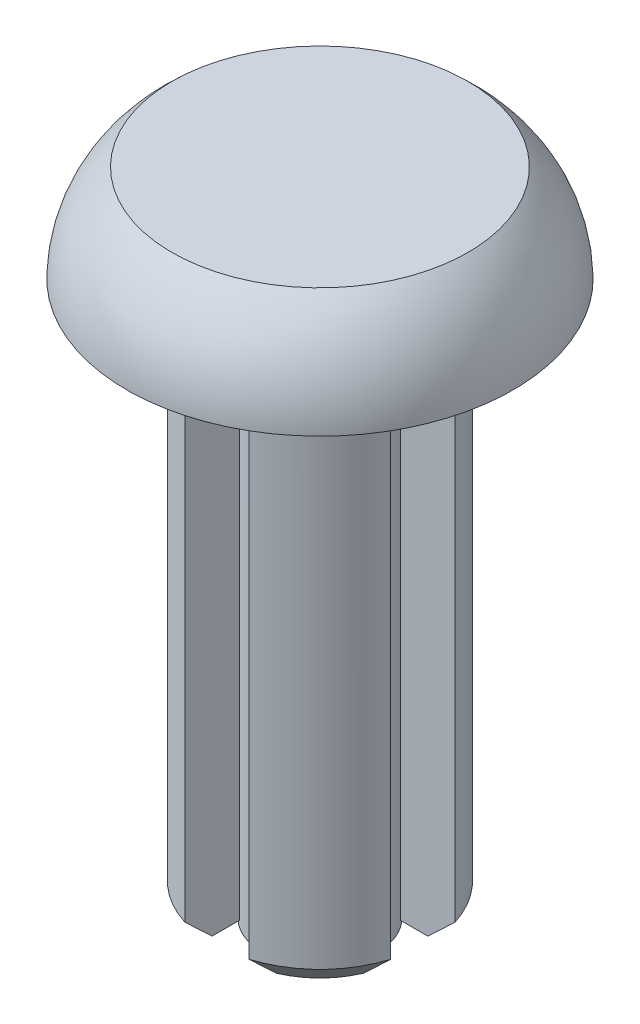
ISO-10303-21;
HEADER;
FILE_DESCRIPTION(('STEP AP214'),'2;1');
FILE_NAME('part.step','',(''),(''),'','','');
FILE_SCHEMA(('AUTOMOTIVE_DESIGN { 1 0 10303 214 1 1 1 1 }'));
ENDSEC;
DATA;
#1=APPLICATION_CONTEXT('core data for automotive mechanical design processes');
#2=APPLICATION_PROTOCOL_DEFINITION('international standard','automotive_design',2000,#1);
#3=PRODUCT_CONTEXT('',#1,'mechanical');
#4=PRODUCT('Part','Part','',(#3));
#5=PRODUCT_RELATED_PRODUCT_CATEGORY('part','',(#4));
#6=PRODUCT_DEFINITION_FORMATION('','',#4);
#7=PRODUCT_DEFINITION_CONTEXT('part definition',#1,'design');
#8=PRODUCT_DEFINITION('design','',#6,#7);
#9=PRODUCT_DEFINITION_SHAPE('','',#8);
#10=(LENGTH_UNIT() NAMED_UNIT(*) SI_UNIT(.MILLI.,.METRE.));
#11=(NAMED_UNIT(*) PLANE_ANGLE_UNIT() SI_UNIT($,.RADIAN.));
#12=(NAMED_UNIT(*) SI_UNIT($,.STERADIAN.) SOLID_ANGLE_UNIT());
#13=UNCERTAINTY_MEASURE_WITH_UNIT(LENGTH_MEASURE(1.E-05),#10,'distance_accuracy_value','');
#14=(GEOMETRIC_REPRESENTATION_CONTEXT(3) GLOBAL_UNCERTAINTY_ASSIGNED_CONTEXT((#13)) GLOBAL_UNIT_ASSIGNED_CONTEXT((#10,
#11,#12)) REPRESENTATION_CONTEXT('',''));
#15=CARTESIAN_POINT('',(0.,0.,0.));
#16=DIRECTION('',(0.,0.,1.));
#17=DIRECTION('',(1.,0.,0.));
#18=AXIS2_PLACEMENT_3D('',#15,#16,#17);
#19=CARTESIAN_POINT('',(0.,-10.804394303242,-1.143));
#20=DIRECTION('',(0.,1.,0.));
#21=DIRECTION('',(0.,0.,1.));
#22=AXIS2_PLACEMENT_3D('',#19,#20,#21);
#23=PLANE('',#22);
#24=DIRECTION('',(1.,0.,0.));
#25=VECTOR('',#24,1.);
#26=CARTESIAN_POINT('',(-2.03026292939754,-10.804394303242,-0.634999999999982));
#27=LINE('',#26,#25);
#28=CARTESIAN_POINT('',(-1.48954542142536,-10.804394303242,-0.634999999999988));
#29=VERTEX_POINT('',#28);
#30=CARTESIAN_POINT('',(-0.950380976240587,-10.804394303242,-0.634999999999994));
#31=VERTEX_POINT('',#30);
#32=EDGE_CURVE('E195',#29,#31,#27,.T.);
#33=ORIENTED_EDGE('',*,*,#32,.F.);
#34=CARTESIAN_POINT('',(0.,-10.804394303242,0.));
#35=DIRECTION('',(0.,1.,0.));
#36=DIRECTION('',(0.,0.,1.));
#37=AXIS2_PLACEMENT_3D('',#34,#35,#36);
#38=CIRCLE('',#37,1.61924999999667);
#39=CARTESIAN_POINT('',(-0.635000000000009,-10.804394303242,-1.48954542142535));
#40=VERTEX_POINT('',#39);
#41=EDGE_CURVE('E309',#29,#40,#38,.F.);
#42=ORIENTED_EDGE('',*,*,#41,.T.);
#43=DIRECTION('',(0.,0.,-1.));
#44=VECTOR('',#43,1.);
#45=CARTESIAN_POINT('',(-0.635000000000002,-10.804394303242,-0.950380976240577));
#46=LINE('',#45,#44);
#47=CARTESIAN_POINT('',(-0.635000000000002,-10.804394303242,-0.950380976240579));
#48=VERTEX_POINT('',#47);
#49=EDGE_CURVE('E205',#48,#40,#46,.T.);
#50=ORIENTED_EDGE('',*,*,#49,.F.);
#51=CARTESIAN_POINT('',(0.,-10.804394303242,0.));
#52=DIRECTION('',(0.,-1.,0.));
#53=DIRECTION('',(0.,0.,-1.));
#54=AXIS2_PLACEMENT_3D('',#51,#52,#53);
#55=CIRCLE('',#54,1.143);
#56=EDGE_CURVE('E294',#31,#48,#55,.T.);
#57=ORIENTED_EDGE('',*,*,#56,.F.);
#58=EDGE_LOOP('',(#33,#42,#50,#57));
#59=FACE_BOUND('',#58,.T.);
#60=ADVANCED_FACE('F30',(#59),#23,.F.);
#61=DIRECTION('',(0.,0.,1.));
#62=VECTOR('',#61,1.);
#63=CARTESIAN_POINT('',(0.63499999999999,-10.804394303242,-2.03026292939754));
#64=LINE('',#63,#62);
#65=CARTESIAN_POINT('',(0.634999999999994,-10.804394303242,-1.48954542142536));
#66=VERTEX_POINT('',#65);
#67=CARTESIAN_POINT('',(0.634999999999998,-10.804394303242,-0.950380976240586));
#68=VERTEX_POINT('',#67);
#69=EDGE_CURVE('E214',#66,#68,#64,.T.);
#70=ORIENTED_EDGE('',*,*,#69,.F.);
#71=CARTESIAN_POINT('',(0.,-10.804394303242,0.));
#72=DIRECTION('',(0.,1.,0.));
#73=DIRECTION('',(0.,0.,1.));
#74=AXIS2_PLACEMENT_3D('',#71,#72,#73);
#75=CIRCLE('',#74,1.61924999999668);
#76=CARTESIAN_POINT('',(1.48954542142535,-10.804394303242,-0.635000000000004));
#77=VERTEX_POINT('',#76);
#78=EDGE_CURVE('E480',#66,#77,#75,.F.);
#79=ORIENTED_EDGE('',*,*,#78,.T.);
#80=DIRECTION('',(1.,0.,0.));
#81=VECTOR('',#80,1.);
#82=CARTESIAN_POINT('',(0.95038097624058,-10.804394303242,-0.635));
#83=LINE('',#82,#81);
#84=CARTESIAN_POINT('',(0.950380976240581,-10.804394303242,-0.635));
#85=VERTEX_POINT('',#84);
#86=EDGE_CURVE('E229',#85,#77,#83,.T.);
#87=ORIENTED_EDGE('',*,*,#86,.F.);
#88=EDGE_CURVE('E460',#68,#85,#55,.T.);
#89=ORIENTED_EDGE('',*,*,#88,.F.);
#90=EDGE_LOOP('',(#70,#79,#87,#89));
#91=FACE_BOUND('',#90,.T.);
#92=ADVANCED_FACE('F429',(#91),#23,.F.);
#93=DIRECTION('',(-1.,0.,0.));
#94=VECTOR('',#93,1.);
#95=CARTESIAN_POINT('',(2.03026292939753,-10.804394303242,0.634999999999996));
#96=LINE('',#95,#94);
#97=CARTESIAN_POINT('',(1.48954542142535,-10.804394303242,0.634999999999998));
#98=VERTEX_POINT('',#97);
#99=CARTESIAN_POINT('',(0.950380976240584,-10.804394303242,0.635000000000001));
#100=VERTEX_POINT('',#99);
#101=EDGE_CURVE('E242',#98,#100,#96,.T.);
#102=ORIENTED_EDGE('',*,*,#101,.F.);
#103=CARTESIAN_POINT('',(0.,-10.804394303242,0.));
#104=DIRECTION('',(0.,1.,0.));
#105=DIRECTION('',(0.,0.,1.));
#106=AXIS2_PLACEMENT_3D('',#103,#104,#105);
#107=CIRCLE('',#106,1.61924999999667);
#108=CARTESIAN_POINT('',(0.635,-10.804394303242,1.48954542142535));
#109=VERTEX_POINT('',#108);
#110=EDGE_CURVE('E382',#98,#109,#107,.F.);
#111=ORIENTED_EDGE('',*,*,#110,.T.);
#112=DIRECTION('',(0.,0.,1.));
#113=VECTOR('',#112,1.);
#114=CARTESIAN_POINT('',(0.634999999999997,-10.804394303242,0.950380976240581));
#115=LINE('',#114,#113);
#116=CARTESIAN_POINT('',(0.634999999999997,-10.804394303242,0.950380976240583));
#117=VERTEX_POINT('',#116);
#118=EDGE_CURVE('E257',#117,#109,#115,.T.);
#119=ORIENTED_EDGE('',*,*,#118,.F.);
#120=EDGE_CURVE('E283',#100,#117,#55,.T.);
#121=ORIENTED_EDGE('',*,*,#120,.F.);
#122=EDGE_LOOP('',(#102,#111,#119,#121));
#123=FACE_BOUND('',#122,.T.);
#124=ADVANCED_FACE('F397',(#123),#23,.F.);
#125=CARTESIAN_POINT('',(-2.12724999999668,0.904999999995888,0.));
#126=DIRECTION('',(0.,-1.,0.));
#127=DIRECTION('',(1.,0.,0.));
#128=AXIS2_PLACEMENT_3D('',#125,#126,#127);
#129=PLANE('',#128);
#130=CARTESIAN_POINT('',(0.,0.904999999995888,0.));
#131=DIRECTION('',(0.,1.,0.));
#132=DIRECTION('',(-1.,0.,0.));
#133=AXIS2_PLACEMENT_3D('',#130,#131,#132);
#134=CIRCLE('',#133,2.12724999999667);
#135=CARTESIAN_POINT('',(-2.12724999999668,0.904999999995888,0.));
#136=VERTEX_POINT('',#135);
#137=EDGE_CURVE('E306',#136,#136,#134,.T.);
#138=ORIENTED_EDGE('',*,*,#137,.T.);
#139=EDGE_LOOP('',(#138));
#140=FACE_BOUND('',#139,.T.);
#141=CARTESIAN_POINT('',(0.,0.904999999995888,0.));
#142=DIRECTION('',(0.,1.,0.));
#143=DIRECTION('',(-1.,0.,0.));
#144=AXIS2_PLACEMENT_3D('',#141,#142,#143);
#145=CIRCLE('',#144,2.4907148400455);
#146=CARTESIAN_POINT('',(-2.49071484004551,0.904999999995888,0.));
#147=VERTEX_POINT('',#146);
#148=EDGE_CURVE('E293',#147,#147,#145,.T.);
#149=ORIENTED_EDGE('',*,*,#148,.F.);
#150=EDGE_LOOP('',(#149));
#151=FACE_BOUND('',#150,.T.);
#152=ADVANCED_FACE('F422',(#140,#151),#129,.T.);
#153=CARTESIAN_POINT('',(0.,1.90499999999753,0.));
#154=DIRECTION('',(0.,1.,0.));
#155=DIRECTION('',(-1.,0.,0.));
#156=AXIS2_PLACEMENT_3D('',#153,#154,#155);
#157=CYLINDRICAL_SURFACE('',#156,2.12724999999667);
#158=DIRECTION('',(0.,-1.,0.));
#159=VECTOR('',#158,1.);
#160=CARTESIAN_POINT('',(-0.635000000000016,-0.64439430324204,-2.03026292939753));
#161=LINE('',#160,#159);
#162=CARTESIAN_POINT('',(-0.635000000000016,-0.64439430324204,-2.03026292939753));
#163=VERTEX_POINT('',#162);
#164=CARTESIAN_POINT('',(-0.635000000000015,-10.296394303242,-2.03026292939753));
#165=VERTEX_POINT('',#164);
#166=EDGE_CURVE('E233',#163,#165,#161,.T.);
#167=ORIENTED_EDGE('',*,*,#166,.T.);
#168=CARTESIAN_POINT('',(0.,-10.296394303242,0.));
#169=DIRECTION('',(0.,1.,0.));
#170=DIRECTION('',(-1.,0.,0.));
#171=AXIS2_PLACEMENT_3D('',#168,#169,#170);
#172=CIRCLE('',#171,2.12724999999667);
#173=CARTESIAN_POINT('',(-2.03026292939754,-10.296394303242,-0.634999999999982));
#174=VERTEX_POINT('',#173);
#175=EDGE_CURVE('E447',#165,#174,#172,.T.);
#176=ORIENTED_EDGE('',*,*,#175,.T.);
#177=DIRECTION('',(0.,-1.,0.));
#178=VECTOR('',#177,1.);
#179=CARTESIAN_POINT('',(-2.03026292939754,-0.64439430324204,-0.634999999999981));
#180=LINE('',#179,#178);
#181=CARTESIAN_POINT('',(-2.03026292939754,-0.64439430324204,-0.634999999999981));
#182=VERTEX_POINT('',#181);
#183=EDGE_CURVE('E206',#182,#174,#180,.T.);
#184=ORIENTED_EDGE('',*,*,#183,.F.);
#185=CARTESIAN_POINT('',(0.,-0.64439430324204,0.));
#186=DIRECTION('',(0.,-1.,0.));
#187=DIRECTION('',(1.,0.,0.));
#188=AXIS2_PLACEMENT_3D('',#185,#186,#187);
#189=CIRCLE('',#188,2.12724999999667);
#190=CARTESIAN_POINT('',(-2.03026292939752,-0.64439430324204,0.635000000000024));
#191=VERTEX_POINT('',#190);
#192=EDGE_CURVE('E191',#191,#182,#189,.T.);
#193=ORIENTED_EDGE('',*,*,#192,.F.);
#194=DIRECTION('',(0.,-1.,0.));
#195=VECTOR('',#194,1.);
#196=CARTESIAN_POINT('',(-2.03026292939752,-0.64439430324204,0.635000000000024));
#197=LINE('',#196,#195);
#198=CARTESIAN_POINT('',(-2.03026292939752,-10.296394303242,0.635000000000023));
#199=VERTEX_POINT('',#198);
#200=EDGE_CURVE('E182',#191,#199,#197,.T.);
#201=ORIENTED_EDGE('',*,*,#200,.T.);
#202=CARTESIAN_POINT('',(0.,-10.296394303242,0.));
#203=DIRECTION('',(0.,1.,0.));
#204=DIRECTION('',(-1.,0.,0.));
#205=AXIS2_PLACEMENT_3D('',#202,#203,#204);
#206=CIRCLE('',#205,2.12724999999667);
#207=CARTESIAN_POINT('',(-0.635000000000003,-10.296394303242,2.03026292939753));
#208=VERTEX_POINT('',#207);
#209=EDGE_CURVE('E469',#199,#208,#206,.T.);
#210=ORIENTED_EDGE('',*,*,#209,.T.);
#211=DIRECTION('',(0.,-1.,0.));
#212=VECTOR('',#211,1.);
#213=CARTESIAN_POINT('',(-0.635000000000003,-0.64439430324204,2.03026292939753));
#214=LINE('',#213,#212);
#215=CARTESIAN_POINT('',(-0.635000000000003,-0.64439430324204,2.03026292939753));
#216=VERTEX_POINT('',#215);
#217=EDGE_CURVE('E284',#216,#208,#214,.T.);
#218=ORIENTED_EDGE('',*,*,#217,.F.);
#219=CARTESIAN_POINT('',(0.,-0.64439430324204,0.));
#220=DIRECTION('',(0.,-1.,0.));
#221=DIRECTION('',(0.,0.,-1.));
#222=AXIS2_PLACEMENT_3D('',#219,#220,#221);
#223=CIRCLE('',#222,2.12724999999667);
#224=CARTESIAN_POINT('',(0.635000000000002,-0.64439430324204,2.03026292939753));
#225=VERTEX_POINT('',#224);
#226=EDGE_CURVE('E272',#225,#216,#223,.T.);
#227=ORIENTED_EDGE('',*,*,#226,.F.);
#228=DIRECTION('',(0.,-1.,0.));
#229=VECTOR('',#228,1.);
#230=CARTESIAN_POINT('',(0.635000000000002,-0.64439430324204,2.03026292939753));
#231=LINE('',#230,#229);
#232=CARTESIAN_POINT('',(0.635000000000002,-10.296394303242,2.03026292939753));
#233=VERTEX_POINT('',#232);
#234=EDGE_CURVE('E287',#225,#233,#231,.T.);
#235=ORIENTED_EDGE('',*,*,#234,.T.);
#236=CARTESIAN_POINT('',(0.,-10.296394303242,0.));
#237=DIRECTION('',(0.,1.,0.));
#238=DIRECTION('',(-1.,0.,0.));
#239=AXIS2_PLACEMENT_3D('',#236,#237,#238);
#240=CIRCLE('',#239,2.12724999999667);
#241=CARTESIAN_POINT('',(2.03026292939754,-10.296394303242,0.634999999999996));
#242=VERTEX_POINT('',#241);
#243=EDGE_CURVE('E319',#233,#242,#240,.T.);
#244=ORIENTED_EDGE('',*,*,#243,.T.);
#245=DIRECTION('',(0.,-1.,0.));
#246=VECTOR('',#245,1.);
#247=CARTESIAN_POINT('',(2.03026292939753,-0.64439430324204,0.634999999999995));
#248=LINE('',#247,#246);
#249=CARTESIAN_POINT('',(2.03026292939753,-0.64439430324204,0.634999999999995));
#250=VERTEX_POINT('',#249);
#251=EDGE_CURVE('E258',#250,#242,#248,.T.);
#252=ORIENTED_EDGE('',*,*,#251,.F.);
#253=CARTESIAN_POINT('',(0.,-0.64439430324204,0.));
#254=DIRECTION('',(0.,-1.,0.));
#255=DIRECTION('',(-1.,0.,0.));
#256=AXIS2_PLACEMENT_3D('',#253,#254,#255);
#257=CIRCLE('',#256,2.12724999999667);
#258=CARTESIAN_POINT('',(2.03026292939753,-0.64439430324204,-0.635000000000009));
#259=VERTEX_POINT('',#258);
#260=EDGE_CURVE('E245',#259,#250,#257,.T.);
#261=ORIENTED_EDGE('',*,*,#260,.F.);
#262=DIRECTION('',(0.,-1.,0.));
#263=VECTOR('',#262,1.);
#264=CARTESIAN_POINT('',(2.03026292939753,-0.64439430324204,-0.635000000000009));
#265=LINE('',#264,#263);
#266=CARTESIAN_POINT('',(2.03026292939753,-10.296394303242,-0.635000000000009));
#267=VERTEX_POINT('',#266);
#268=EDGE_CURVE('E260',#259,#267,#265,.T.);
#269=ORIENTED_EDGE('',*,*,#268,.T.);
#270=CARTESIAN_POINT('',(0.,-10.296394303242,0.));
#271=DIRECTION('',(0.,1.,0.));
#272=DIRECTION('',(-1.,0.,0.));
#273=AXIS2_PLACEMENT_3D('',#270,#271,#272);
#274=CIRCLE('',#273,2.12724999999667);
#275=CARTESIAN_POINT('',(0.63499999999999,-10.296394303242,-2.03026292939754));
#276=VERTEX_POINT('',#275);
#277=EDGE_CURVE('E470',#267,#276,#274,.T.);
#278=ORIENTED_EDGE('',*,*,#277,.T.);
#279=DIRECTION('',(0.,-1.,0.));
#280=VECTOR('',#279,1.);
#281=CARTESIAN_POINT('',(0.634999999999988,-0.64439430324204,-2.03026292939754));
#282=LINE('',#281,#280);
#283=CARTESIAN_POINT('',(0.634999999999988,-0.64439430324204,-2.03026292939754));
#284=VERTEX_POINT('',#283);
#285=EDGE_CURVE('E230',#284,#276,#282,.T.);
#286=ORIENTED_EDGE('',*,*,#285,.F.);
#287=CARTESIAN_POINT('',(0.,-0.64439430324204,0.));
#288=DIRECTION('',(0.,-1.,0.));
#289=DIRECTION('',(0.,0.,1.));
#290=AXIS2_PLACEMENT_3D('',#287,#288,#289);
#291=CIRCLE('',#290,2.12724999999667);
#292=EDGE_CURVE('E217',#163,#284,#291,.T.);
#293=ORIENTED_EDGE('',*,*,#292,.F.);
#294=EDGE_LOOP('',(#167,#176,#184,#193,#201,#210,#218,#227,#235,#244,#252,#261,#269,#278,#286,#293));
#295=FACE_BOUND('',#294,.T.);
#296=ORIENTED_EDGE('',*,*,#137,.F.);
#297=EDGE_LOOP('',(#296));
#298=FACE_BOUND('',#297,.T.);
#299=ADVANCED_FACE('F416',(#295,#298),#157,.T.);
#300=CARTESIAN_POINT('',(0.,1.90499999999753,0.));
#301=DIRECTION('',(0.,1.,0.));
#302=DIRECTION('',(-1.,0.,0.));
#303=AXIS2_PLACEMENT_3D('',#300,#301,#302);
#304=PLANE('',#303);
#305=CARTESIAN_POINT('',(0.,1.90499999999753,0.));
#306=DIRECTION('',(0.,1.,0.));
#307=DIRECTION('',(-1.,0.,0.));
#308=AXIS2_PLACEMENT_3D('',#305,#306,#307);
#309=CIRCLE('',#308,2.921);
#310=CARTESIAN_POINT('',(-2.92100000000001,1.90499999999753,0.));
#311=VERTEX_POINT('',#310);
#312=EDGE_CURVE('E303',#311,#311,#309,.T.);
#313=ORIENTED_EDGE('',*,*,#312,.T.);
#314=EDGE_LOOP('',(#313));
#315=FACE_BOUND('',#314,.T.);
#316=ADVANCED_FACE('F412',(#315),#304,.T.);
#317=CARTESIAN_POINT('',(0.,-0.0595861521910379,0.));
#318=DIRECTION('',(0.,1.,0.));
#319=DIRECTION('',(-1.,0.,0.));
#320=AXIS2_PLACEMENT_3D('',#317,#318,#319);
#321=DEGENERATE_TOROIDAL_SURFACE('',#320,1.19674395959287,2.61393527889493,.T.);
#322=CARTESIAN_POINT('',(0.,0.,0.));
#323=DIRECTION('',(0.,1.,0.));
#324=DIRECTION('',(-1.,0.,0.));
#325=AXIS2_PLACEMENT_3D('',#322,#323,#324);
#326=CIRCLE('',#325,3.8099999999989);
#327=CARTESIAN_POINT('',(-3.80999999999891,0.,0.));
#328=VERTEX_POINT('',#327);
#329=EDGE_CURVE('E300',#328,#328,#326,.T.);
#330=ORIENTED_EDGE('',*,*,#329,.T.);
#331=EDGE_LOOP('',(#330));
#332=FACE_BOUND('',#331,.T.);
#333=ORIENTED_EDGE('',*,*,#312,.F.);
#334=EDGE_LOOP('',(#333));
#335=FACE_BOUND('',#334,.T.);
#336=ADVANCED_FACE('F408',(#332,#335),#321,.T.);
#337=CARTESIAN_POINT('',(0.,0.,0.));
#338=DIRECTION('',(0.,1.,0.));
#339=DIRECTION('',(-1.,0.,0.));
#340=AXIS2_PLACEMENT_3D('',#337,#338,#339);
#341=CONICAL_SURFACE('',#340,3.8099999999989,1.5479987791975);
#342=CARTESIAN_POINT('',(0.,-0.0227955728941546,0.));
#343=DIRECTION('',(0.,1.,0.));
#344=DIRECTION('',(-1.,0.,0.));
#345=AXIS2_PLACEMENT_3D('',#342,#343,#344);
#346=CIRCLE('',#345,2.81025985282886);
#347=CARTESIAN_POINT('',(-2.81025985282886,-0.0227955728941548,0.));
#348=VERTEX_POINT('',#347);
#349=EDGE_CURVE('E297',#348,#348,#346,.T.);
#350=ORIENTED_EDGE('',*,*,#349,.T.);
#351=EDGE_LOOP('',(#350));
#352=FACE_BOUND('',#351,.T.);
#353=ORIENTED_EDGE('',*,*,#329,.F.);
#354=EDGE_LOOP('',(#353));
#355=FACE_BOUND('',#354,.T.);
#356=ADVANCED_FACE('F404',(#352,#355),#341,.T.);
#357=CARTESIAN_POINT('',(0.,-0.0595861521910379,0.));
#358=DIRECTION('',(0.,1.,0.));
#359=DIRECTION('',(-1.,0.,0.));
#360=AXIS2_PLACEMENT_3D('',#357,#358,#359);
#361=DEGENERATE_TOROIDAL_SURFACE('',#360,1.19674395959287,1.61393527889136,.T.);
#362=ORIENTED_EDGE('',*,*,#148,.T.);
#363=EDGE_LOOP('',(#362));
#364=FACE_BOUND('',#363,.T.);
#365=ORIENTED_EDGE('',*,*,#349,.F.);
#366=EDGE_LOOP('',(#365));
#367=FACE_BOUND('',#366,.T.);
#368=ADVANCED_FACE('F400',(#364,#367),#361,.F.);
#369=CARTESIAN_POINT('',(0.,-11.4394,0.));
#370=DIRECTION('',(0.,-1.,0.));
#371=DIRECTION('',(0.,0.,-1.));
#372=AXIS2_PLACEMENT_3D('',#369,#370,#371);
#373=CYLINDRICAL_SURFACE('',#372,1.143);
#374=CARTESIAN_POINT('',(0.,-10.9314,0.));
#375=DIRECTION('',(0.,-1.,0.));
#376=DIRECTION('',(0.,0.,-1.));
#377=AXIS2_PLACEMENT_3D('',#374,#375,#376);
#378=CIRCLE('',#377,1.143);
#379=CARTESIAN_POINT('',(0.,-10.9314,-1.143));
#380=VERTEX_POINT('',#379);
#381=EDGE_CURVE('E11',#380,#380,#378,.F.);
#382=ORIENTED_EDGE('',*,*,#381,.T.);
#383=EDGE_LOOP('',(#382));
#384=FACE_BOUND('',#383,.T.);
#385=CARTESIAN_POINT('',(-0.635000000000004,-10.804394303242,0.950380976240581));
#386=VERTEX_POINT('',#385);
#387=CARTESIAN_POINT('',(-0.950380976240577,-10.804394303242,0.635000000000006));
#388=VERTEX_POINT('',#387);
#389=EDGE_CURVE('E178',#386,#388,#55,.T.);
#390=ORIENTED_EDGE('',*,*,#389,.T.);
#391=DIRECTION('',(0.,-1.,0.));
#392=VECTOR('',#391,1.);
#393=CARTESIAN_POINT('',(-0.950380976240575,-0.64439430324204,0.635000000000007));
#394=LINE('',#393,#392);
#395=CARTESIAN_POINT('',(-0.950380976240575,-0.64439430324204,0.635000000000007));
#396=VERTEX_POINT('',#395);
#397=EDGE_CURVE('E169',#396,#388,#394,.T.);
#398=ORIENTED_EDGE('',*,*,#397,.F.);
#399=CARTESIAN_POINT('',(0.,-0.64439430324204,0.));
#400=DIRECTION('',(0.,1.,0.));
#401=DIRECTION('',(1.,0.,0.));
#402=AXIS2_PLACEMENT_3D('',#399,#400,#401);
#403=CIRCLE('',#402,1.143);
#404=CARTESIAN_POINT('',(-0.950380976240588,-0.64439430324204,-0.634999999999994));
#405=VERTEX_POINT('',#404);
#406=EDGE_CURVE('E174',#405,#396,#403,.T.);
#407=ORIENTED_EDGE('',*,*,#406,.F.);
#408=DIRECTION('',(0.,-1.,0.));
#409=VECTOR('',#408,1.);
#410=CARTESIAN_POINT('',(-0.950380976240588,-0.64439430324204,-0.634999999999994));
#411=LINE('',#410,#409);
#412=EDGE_CURVE('E203',#405,#31,#411,.T.);
#413=ORIENTED_EDGE('',*,*,#412,.T.);
#414=ORIENTED_EDGE('',*,*,#56,.T.);
#415=DIRECTION('',(0.,-1.,0.));
#416=VECTOR('',#415,1.);
#417=CARTESIAN_POINT('',(-0.635000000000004,-0.64439430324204,-0.950380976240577));
#418=LINE('',#417,#416);
#419=CARTESIAN_POINT('',(-0.635000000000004,-0.64439430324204,-0.950380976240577));
#420=VERTEX_POINT('',#419);
#421=EDGE_CURVE('E222',#420,#48,#418,.T.);
#422=ORIENTED_EDGE('',*,*,#421,.F.);
#423=CARTESIAN_POINT('',(0.,-0.64439430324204,0.));
#424=DIRECTION('',(0.,1.,0.));
#425=DIRECTION('',(0.,0.,1.));
#426=AXIS2_PLACEMENT_3D('',#423,#424,#425);
#427=CIRCLE('',#426,1.143);
#428=CARTESIAN_POINT('',(0.634999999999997,-0.64439430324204,-0.950380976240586));
#429=VERTEX_POINT('',#428);
#430=EDGE_CURVE('E210',#429,#420,#427,.T.);
#431=ORIENTED_EDGE('',*,*,#430,.F.);
#432=DIRECTION('',(0.,-1.,0.));
#433=VECTOR('',#432,1.);
#434=CARTESIAN_POINT('',(0.634999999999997,-0.64439430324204,-0.950380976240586));
#435=LINE('',#434,#433);
#436=EDGE_CURVE('E226',#429,#68,#435,.T.);
#437=ORIENTED_EDGE('',*,*,#436,.T.);
#438=ORIENTED_EDGE('',*,*,#88,.T.);
#439=DIRECTION('',(0.,-1.,0.));
#440=VECTOR('',#439,1.);
#441=CARTESIAN_POINT('',(0.950380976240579,-0.64439430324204,-0.635));
#442=LINE('',#441,#440);
#443=CARTESIAN_POINT('',(0.950380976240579,-0.64439430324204,-0.635));
#444=VERTEX_POINT('',#443);
#445=EDGE_CURVE('E250',#444,#85,#442,.T.);
#446=ORIENTED_EDGE('',*,*,#445,.F.);
#447=CARTESIAN_POINT('',(0.,-0.64439430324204,0.));
#448=DIRECTION('',(0.,1.,0.));
#449=DIRECTION('',(-1.,0.,0.));
#450=AXIS2_PLACEMENT_3D('',#447,#448,#449);
#451=CIRCLE('',#450,1.143);
#452=CARTESIAN_POINT('',(0.950380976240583,-0.64439430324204,0.635));
#453=VERTEX_POINT('',#452);
#454=EDGE_CURVE('E238',#453,#444,#451,.T.);
#455=ORIENTED_EDGE('',*,*,#454,.F.);
#456=DIRECTION('',(0.,-1.,0.));
#457=VECTOR('',#456,1.);
#458=CARTESIAN_POINT('',(0.950380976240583,-0.64439430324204,0.635));
#459=LINE('',#458,#457);
#460=EDGE_CURVE('E254',#453,#100,#459,.T.);
#461=ORIENTED_EDGE('',*,*,#460,.T.);
#462=ORIENTED_EDGE('',*,*,#120,.T.);
#463=DIRECTION('',(0.,-1.,0.));
#464=VECTOR('',#463,1.);
#465=CARTESIAN_POINT('',(0.634999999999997,-0.64439430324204,0.950380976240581));
#466=LINE('',#465,#464);
#467=CARTESIAN_POINT('',(0.634999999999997,-0.64439430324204,0.950380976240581));
#468=VERTEX_POINT('',#467);
#469=EDGE_CURVE('E277',#468,#117,#466,.T.);
#470=ORIENTED_EDGE('',*,*,#469,.F.);
#471=CARTESIAN_POINT('',(0.,-0.64439430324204,0.));
#472=DIRECTION('',(0.,1.,0.));
#473=DIRECTION('',(0.,0.,-1.));
#474=AXIS2_PLACEMENT_3D('',#471,#472,#473);
#475=CIRCLE('',#474,1.143);
#476=CARTESIAN_POINT('',(-0.635000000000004,-0.64439430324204,0.950380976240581));
#477=VERTEX_POINT('',#476);
#478=EDGE_CURVE('E265',#477,#468,#475,.T.);
#479=ORIENTED_EDGE('',*,*,#478,.F.);
#480=DIRECTION('',(0.,-1.,0.));
#481=VECTOR('',#480,1.);
#482=CARTESIAN_POINT('',(-0.635000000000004,-0.64439430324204,0.950380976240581));
#483=LINE('',#482,#481);
#484=EDGE_CURVE('E281',#477,#386,#483,.T.);
#485=ORIENTED_EDGE('',*,*,#484,.T.);
#486=EDGE_LOOP('',(#390,#398,#407,#413,#414,#422,#431,#437,#438,#446,#455,#461,#462,#470,#479,#485));
#487=FACE_BOUND('',#486,.T.);
#488=ADVANCED_FACE('F171',(#384,#487),#373,.T.);
#489=DIRECTION('',(0.,0.,-1.));
#490=VECTOR('',#489,1.);
#491=CARTESIAN_POINT('',(-0.635000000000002,-10.804394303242,2.03026292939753));
#492=LINE('',#491,#490);
#493=CARTESIAN_POINT('',(-0.635000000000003,-10.804394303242,1.48954542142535));
#494=VERTEX_POINT('',#493);
#495=EDGE_CURVE('E269',#494,#386,#492,.T.);
#496=ORIENTED_EDGE('',*,*,#495,.F.);
#497=CARTESIAN_POINT('',(0.,-10.804394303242,0.));
#498=DIRECTION('',(0.,1.,0.));
#499=DIRECTION('',(0.,0.,1.));
#500=AXIS2_PLACEMENT_3D('',#497,#498,#499);
#501=CIRCLE('',#500,1.61924999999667);
#502=CARTESIAN_POINT('',(-1.48954542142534,-10.804394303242,0.635000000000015));
#503=VERTEX_POINT('',#502);
#504=EDGE_CURVE('E678',#494,#503,#501,.F.);
#505=ORIENTED_EDGE('',*,*,#504,.T.);
#506=DIRECTION('',(-1.,0.,0.));
#507=VECTOR('',#506,1.);
#508=CARTESIAN_POINT('',(-0.950380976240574,-10.804394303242,0.635000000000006));
#509=LINE('',#508,#507);
#510=EDGE_CURVE('E197',#388,#503,#509,.T.);
#511=ORIENTED_EDGE('',*,*,#510,.F.);
#512=ORIENTED_EDGE('',*,*,#389,.F.);
#513=EDGE_LOOP('',(#496,#505,#511,#512));
#514=FACE_BOUND('',#513,.T.);
#515=ADVANCED_FACE('F393',(#514),#23,.F.);
#516=CARTESIAN_POINT('',(-2.12724999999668,-11.4394,0.));
#517=DIRECTION('',(0.,-1.,0.));
#518=DIRECTION('',(1.,0.,0.));
#519=AXIS2_PLACEMENT_3D('',#516,#517,#518);
#520=PLANE('',#519);
#521=CARTESIAN_POINT('',(0.,-11.4394,0.));
#522=DIRECTION('',(0.,-1.,0.));
#523=DIRECTION('',(1.,0.,0.));
#524=AXIS2_PLACEMENT_3D('',#521,#522,#523);
#525=CIRCLE('',#524,0.634999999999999);
#526=CARTESIAN_POINT('',(0.634999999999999,-11.4394,0.));
#527=VERTEX_POINT('',#526);
#528=EDGE_CURVE('E38',#527,#527,#525,.T.);
#529=ORIENTED_EDGE('',*,*,#528,.T.);
#530=EDGE_LOOP('',(#529));
#531=FACE_BOUND('',#530,.T.);
#532=ADVANCED_FACE('F387',(#531),#520,.T.);
#533=CARTESIAN_POINT('',(-0.635000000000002,-0.64439430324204,2.03026292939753));
#534=DIRECTION('',(-1.,0.,0.));
#535=DIRECTION('',(0.,0.,1.));
#536=AXIS2_PLACEMENT_3D('',#533,#534,#535);
#537=PLANE('',#536);
#538=ORIENTED_EDGE('',*,*,#217,.T.);
#539=CARTESIAN_POINT('',(-0.635000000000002,-10.296394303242,2.03026292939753));
#540=CARTESIAN_POINT('',(-0.635000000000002,-10.3390801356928,1.98553535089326));
#541=CARTESIAN_POINT('',(-0.635000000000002,-10.3817028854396,1.9407473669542));
#542=CARTESIAN_POINT('',(-0.635000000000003,-10.466786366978,1.85101953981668));
#543=CARTESIAN_POINT('',(-0.635000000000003,-10.5092471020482,1.80607969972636));
#544=CARTESIAN_POINT('',(-0.635000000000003,-10.5939727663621,1.71601494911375));
#545=CARTESIAN_POINT('',(-0.635000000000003,-10.6362376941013,1.67089003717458));
#546=CARTESIAN_POINT('',(-0.635000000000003,-10.7205174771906,1.58040565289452));
#547=CARTESIAN_POINT('',(-0.635000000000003,-10.7625323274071,1.53504617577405));
#548=CARTESIAN_POINT('',(-0.635000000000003,-10.804394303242,1.48954542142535));
#549=B_SPLINE_CURVE_WITH_KNOTS('',3,(#539,#540,#541,#542,#543,#544,#545,#546,#547,#548),
.UNSPECIFIED.,.F.,.F.,(4,2,2,2,4),(0.,0.185482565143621,0.370961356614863,0.556441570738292,
0.741925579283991),.UNSPECIFIED.);
#550=EDGE_CURVE('E377',#208,#494,#549,.T.);
#551=ORIENTED_EDGE('',*,*,#550,.T.);
#552=ORIENTED_EDGE('',*,*,#495,.T.);
#553=ORIENTED_EDGE('',*,*,#484,.F.);
#554=DIRECTION('',(0.,0.,-1.));
#555=VECTOR('',#554,1.);
#556=CARTESIAN_POINT('',(-0.635000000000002,-0.64439430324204,2.03026292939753));
#557=LINE('',#556,#555);
#558=EDGE_CURVE('E274',#216,#477,#557,.T.);
#559=ORIENTED_EDGE('',*,*,#558,.F.);
#560=EDGE_LOOP('',(#538,#551,#552,#553,#559));
#561=FACE_BOUND('',#560,.T.);
#562=ADVANCED_FACE('F383',(#561),#537,.F.);
#563=CARTESIAN_POINT('',(0.634999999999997,-0.64439430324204,0.950380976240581));
#564=DIRECTION('',(1.,0.,0.));
#565=DIRECTION('',(0.,0.,-1.));
#566=AXIS2_PLACEMENT_3D('',#563,#564,#565);
#567=PLANE('',#566);
#568=ORIENTED_EDGE('',*,*,#118,.T.);
#569=CARTESIAN_POINT('',(0.635,-10.804394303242,1.48954542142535));
#570=CARTESIAN_POINT('',(0.635,-10.7625323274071,1.53504617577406));
#571=CARTESIAN_POINT('',(0.635,-10.7205174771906,1.58040565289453));
#572=CARTESIAN_POINT('',(0.635000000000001,-10.6362376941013,1.67089003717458));
#573=CARTESIAN_POINT('',(0.635000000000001,-10.5939727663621,1.71601494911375));
#574=CARTESIAN_POINT('',(0.635000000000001,-10.5092471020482,1.80607969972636));
#575=CARTESIAN_POINT('',(0.635000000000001,-10.466786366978,1.85101953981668));
#576=CARTESIAN_POINT('',(0.635000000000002,-10.3817028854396,1.9407473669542));
#577=CARTESIAN_POINT('',(0.635000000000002,-10.3390801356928,1.98553535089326));
#578=CARTESIAN_POINT('',(0.635000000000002,-10.296394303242,2.03026292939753));
#579=B_SPLINE_CURVE_WITH_KNOTS('',3,(#569,#570,#571,#572,#573,#574,#575,#576,#577,#578),
.UNSPECIFIED.,.F.,.F.,(4,2,2,2,4),(0.,0.185484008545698,0.370964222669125,0.556443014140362,
0.741925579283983),.UNSPECIFIED.);
#580=EDGE_CURVE('E45',#109,#233,#579,.T.);
#581=ORIENTED_EDGE('',*,*,#580,.T.);
#582=ORIENTED_EDGE('',*,*,#234,.F.);
#583=DIRECTION('',(0.,0.,1.));
#584=VECTOR('',#583,1.);
#585=CARTESIAN_POINT('',(0.634999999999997,-0.64439430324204,0.950380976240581));
#586=LINE('',#585,#584);
#587=EDGE_CURVE('E268',#468,#225,#586,.T.);
#588=ORIENTED_EDGE('',*,*,#587,.F.);
#589=ORIENTED_EDGE('',*,*,#469,.T.);
#590=EDGE_LOOP('',(#568,#581,#582,#588,#589));
#591=FACE_BOUND('',#590,.T.);
#592=ADVANCED_FACE('F386',(#591),#567,.F.);
#593=CARTESIAN_POINT('',(0.,-0.64439430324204,0.));
#594=DIRECTION('',(0.,-1.,0.));
#595=DIRECTION('',(0.,0.,-1.));
#596=AXIS2_PLACEMENT_3D('',#593,#594,#595);
#597=PLANE('',#596);
#598=ORIENTED_EDGE('',*,*,#478,.T.);
#599=ORIENTED_EDGE('',*,*,#587,.T.);
#600=ORIENTED_EDGE('',*,*,#226,.T.);
#601=ORIENTED_EDGE('',*,*,#558,.T.);
#602=EDGE_LOOP('',(#598,#599,#600,#601));
#603=FACE_BOUND('',#602,.T.);
#604=ADVANCED_FACE('F344',(#603),#597,.T.);
#605=CARTESIAN_POINT('',(2.03026292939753,-0.64439430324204,0.634999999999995));
#606=DIRECTION('',(0.,0.,1.));
#607=DIRECTION('',(1.,0.,0.));
#608=AXIS2_PLACEMENT_3D('',#605,#606,#607);
#609=PLANE('',#608);
#610=ORIENTED_EDGE('',*,*,#251,.T.);
#611=CARTESIAN_POINT('',(2.03026292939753,-10.296394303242,0.634999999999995));
#612=CARTESIAN_POINT('',(1.98553535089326,-10.3390801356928,0.634999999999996));
#613=CARTESIAN_POINT('',(1.9407473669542,-10.3817028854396,0.634999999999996));
#614=CARTESIAN_POINT('',(1.85101953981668,-10.466786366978,0.634999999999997));
#615=CARTESIAN_POINT('',(1.80607969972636,-10.5092471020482,0.634999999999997));
#616=CARTESIAN_POINT('',(1.71601494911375,-10.5939727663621,0.634999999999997));
#617=CARTESIAN_POINT('',(1.67089003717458,-10.6362376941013,0.634999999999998));
#618=CARTESIAN_POINT('',(1.58040565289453,-10.7205174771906,0.634999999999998));
#619=CARTESIAN_POINT('',(1.53504617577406,-10.7625323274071,0.634999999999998));
#620=CARTESIAN_POINT('',(1.48954542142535,-10.804394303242,0.634999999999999));
#621=B_SPLINE_CURVE_WITH_KNOTS('',3,(#611,#612,#613,#614,#615,#616,#617,#618,#619,#620),
.UNSPECIFIED.,.F.,.F.,(4,2,2,2,4),(0.,0.185482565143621,0.37096135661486,0.556441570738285,
0.741925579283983),.UNSPECIFIED.);
#622=EDGE_CURVE('E53',#242,#98,#621,.T.);
#623=ORIENTED_EDGE('',*,*,#622,.T.);
#624=ORIENTED_EDGE('',*,*,#101,.T.);
#625=ORIENTED_EDGE('',*,*,#460,.F.);
#626=DIRECTION('',(-1.,0.,0.));
#627=VECTOR('',#626,1.);
#628=CARTESIAN_POINT('',(2.03026292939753,-0.64439430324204,0.634999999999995));
#629=LINE('',#628,#627);
#630=EDGE_CURVE('E247',#250,#453,#629,.T.);
#631=ORIENTED_EDGE('',*,*,#630,.F.);
#632=EDGE_LOOP('',(#610,#623,#624,#625,#631));
#633=FACE_BOUND('',#632,.T.);
#634=ADVANCED_FACE('F340',(#633),#609,.F.);
#635=CARTESIAN_POINT('',(0.950380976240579,-0.64439430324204,-0.635));
#636=DIRECTION('',(0.,0.,-1.));
#637=DIRECTION('',(-1.,0.,0.));
#638=AXIS2_PLACEMENT_3D('',#635,#636,#637);
#639=PLANE('',#638);
#640=ORIENTED_EDGE('',*,*,#86,.T.);
#641=CARTESIAN_POINT('',(1.48954542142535,-10.804394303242,-0.635000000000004));
#642=CARTESIAN_POINT('',(1.53504617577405,-10.7625323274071,-0.635000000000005));
#643=CARTESIAN_POINT('',(1.58040565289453,-10.7205174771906,-0.635000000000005));
#644=CARTESIAN_POINT('',(1.67089003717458,-10.6362376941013,-0.635000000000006));
#645=CARTESIAN_POINT('',(1.71601494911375,-10.5939727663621,-0.635000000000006));
#646=CARTESIAN_POINT('',(1.80607969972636,-10.5092471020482,-0.635000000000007));
#647=CARTESIAN_POINT('',(1.85101953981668,-10.466786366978,-0.635000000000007));
#648=CARTESIAN_POINT('',(1.9407473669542,-10.3817028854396,-0.635000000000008));
#649=CARTESIAN_POINT('',(1.98553535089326,-10.3390801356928,-0.635000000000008));
#650=CARTESIAN_POINT('',(2.03026292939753,-10.296394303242,-0.635000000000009));
#651=B_SPLINE_CURVE_WITH_KNOTS('',3,(#641,#642,#643,#644,#645,#646,#647,#648,#649,#650),
.UNSPECIFIED.,.F.,.F.,(4,2,2,2,4),(0.,0.185484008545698,0.370964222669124,0.556443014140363,
0.741925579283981),.UNSPECIFIED.);
#652=EDGE_CURVE('E681',#77,#267,#651,.T.);
#653=ORIENTED_EDGE('',*,*,#652,.T.);
#654=ORIENTED_EDGE('',*,*,#268,.F.);
#655=DIRECTION('',(1.,0.,0.));
#656=VECTOR('',#655,1.);
#657=CARTESIAN_POINT('',(0.950380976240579,-0.64439430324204,-0.635));
#658=LINE('',#657,#656);
#659=EDGE_CURVE('E241',#444,#259,#658,.T.);
#660=ORIENTED_EDGE('',*,*,#659,.F.);
#661=ORIENTED_EDGE('',*,*,#445,.T.);
#662=EDGE_LOOP('',(#640,#653,#654,#660,#661));
#663=FACE_BOUND('',#662,.T.);
#664=ADVANCED_FACE('F338',(#663),#639,.F.);
#665=CARTESIAN_POINT('',(0.,-0.64439430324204,0.));
#666=DIRECTION('',(0.,-1.,0.));
#667=DIRECTION('',(-1.,0.,0.));
#668=AXIS2_PLACEMENT_3D('',#665,#666,#667);
#669=PLANE('',#668);
#670=ORIENTED_EDGE('',*,*,#454,.T.);
#671=ORIENTED_EDGE('',*,*,#659,.T.);
#672=ORIENTED_EDGE('',*,*,#260,.T.);
#673=ORIENTED_EDGE('',*,*,#630,.T.);
#674=EDGE_LOOP('',(#670,#671,#672,#673));
#675=FACE_BOUND('',#674,.T.);
#676=ADVANCED_FACE('F335',(#675),#669,.T.);
#677=CARTESIAN_POINT('',(0.634999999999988,-0.64439430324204,-2.03026292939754));
#678=DIRECTION('',(1.,0.,0.));
#679=DIRECTION('',(0.,0.,-1.));
#680=AXIS2_PLACEMENT_3D('',#677,#678,#679);
#681=PLANE('',#680);
#682=ORIENTED_EDGE('',*,*,#285,.T.);
#683=CARTESIAN_POINT('',(0.634999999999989,-10.296394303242,-2.03026292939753));
#684=CARTESIAN_POINT('',(0.63499999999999,-10.3390801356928,-1.98553535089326));
#685=CARTESIAN_POINT('',(0.63499999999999,-10.3817028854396,-1.9407473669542));
#686=CARTESIAN_POINT('',(0.634999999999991,-10.466786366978,-1.85101953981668));
#687=CARTESIAN_POINT('',(0.634999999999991,-10.5092471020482,-1.80607969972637));
#688=CARTESIAN_POINT('',(0.634999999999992,-10.5939727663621,-1.71601494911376));
#689=CARTESIAN_POINT('',(0.634999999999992,-10.6362376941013,-1.67089003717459));
#690=CARTESIAN_POINT('',(0.634999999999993,-10.7205174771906,-1.58040565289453));
#691=CARTESIAN_POINT('',(0.634999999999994,-10.7625323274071,-1.53504617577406));
#692=CARTESIAN_POINT('',(0.634999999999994,-10.804394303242,-1.48954542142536));
#693=B_SPLINE_CURVE_WITH_KNOTS('',3,(#683,#684,#685,#686,#687,#688,#689,#690,#691,#692),
.UNSPECIFIED.,.F.,.F.,(4,2,2,2,4),(0.,0.185482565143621,0.370961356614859,0.556441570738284,
0.741925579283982),.UNSPECIFIED.);
#694=EDGE_CURVE('E680',#276,#66,#693,.T.);
#695=ORIENTED_EDGE('',*,*,#694,.T.);
#696=ORIENTED_EDGE('',*,*,#69,.T.);
#697=ORIENTED_EDGE('',*,*,#436,.F.);
#698=DIRECTION('',(0.,0.,1.));
#699=VECTOR('',#698,1.);
#700=CARTESIAN_POINT('',(0.634999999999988,-0.64439430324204,-2.03026292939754));
#701=LINE('',#700,#699);
#702=EDGE_CURVE('E219',#284,#429,#701,.T.);
#703=ORIENTED_EDGE('',*,*,#702,.F.);
#704=EDGE_LOOP('',(#682,#695,#696,#697,#703));
#705=FACE_BOUND('',#704,.T.);
#706=ADVANCED_FACE('F331',(#705),#681,.F.);
#707=CARTESIAN_POINT('',(-0.635000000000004,-0.64439430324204,-0.950380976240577));
#708=DIRECTION('',(-1.,0.,0.));
#709=DIRECTION('',(0.,0.,1.));
#710=AXIS2_PLACEMENT_3D('',#707,#708,#709);
#711=PLANE('',#710);
#712=ORIENTED_EDGE('',*,*,#49,.T.);
#713=CARTESIAN_POINT('',(-0.635000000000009,-10.804394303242,-1.48954542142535));
#714=CARTESIAN_POINT('',(-0.635000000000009,-10.7625323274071,-1.53504617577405));
#715=CARTESIAN_POINT('',(-0.63500000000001,-10.7205174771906,-1.58040565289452));
#716=CARTESIAN_POINT('',(-0.635000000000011,-10.6362376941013,-1.67089003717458));
#717=CARTESIAN_POINT('',(-0.635000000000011,-10.5939727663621,-1.71601494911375));
#718=CARTESIAN_POINT('',(-0.635000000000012,-10.5092471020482,-1.80607969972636));
#719=CARTESIAN_POINT('',(-0.635000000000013,-10.466786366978,-1.85101953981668));
#720=CARTESIAN_POINT('',(-0.635000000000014,-10.3817028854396,-1.94074736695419));
#721=CARTESIAN_POINT('',(-0.635000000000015,-10.3390801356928,-1.98553535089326));
#722=CARTESIAN_POINT('',(-0.635000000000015,-10.296394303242,-2.03026292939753));
#723=B_SPLINE_CURVE_WITH_KNOTS('',3,(#713,#714,#715,#716,#717,#718,#719,#720,#721,#722),
.UNSPECIFIED.,.F.,.F.,(4,2,2,2,4),(0.,0.185484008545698,0.370964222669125,0.556443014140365,
0.741925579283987),.UNSPECIFIED.);
#724=EDGE_CURVE('E312',#40,#165,#723,.T.);
#725=ORIENTED_EDGE('',*,*,#724,.T.);
#726=ORIENTED_EDGE('',*,*,#166,.F.);
#727=DIRECTION('',(0.,0.,-1.));
#728=VECTOR('',#727,1.);
#729=CARTESIAN_POINT('',(-0.635000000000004,-0.64439430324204,-0.950380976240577));
#730=LINE('',#729,#728);
#731=EDGE_CURVE('E213',#420,#163,#730,.T.);
#732=ORIENTED_EDGE('',*,*,#731,.F.);
#733=ORIENTED_EDGE('',*,*,#421,.T.);
#734=EDGE_LOOP('',(#712,#725,#726,#732,#733));
#735=FACE_BOUND('',#734,.T.);
#736=ADVANCED_FACE('F325',(#735),#711,.F.);
#737=CARTESIAN_POINT('',(0.,-0.64439430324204,0.));
#738=DIRECTION('',(0.,-1.,0.));
#739=DIRECTION('',(0.,0.,1.));
#740=AXIS2_PLACEMENT_3D('',#737,#738,#739);
#741=PLANE('',#740);
#742=ORIENTED_EDGE('',*,*,#430,.T.);
#743=ORIENTED_EDGE('',*,*,#731,.T.);
#744=ORIENTED_EDGE('',*,*,#292,.T.);
#745=ORIENTED_EDGE('',*,*,#702,.T.);
#746=EDGE_LOOP('',(#742,#743,#744,#745));
#747=FACE_BOUND('',#746,.T.);
#748=ADVANCED_FACE('F330',(#747),#741,.T.);
#749=CARTESIAN_POINT('',(-2.03026292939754,-0.64439430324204,-0.634999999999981));
#750=DIRECTION('',(0.,0.,-1.));
#751=DIRECTION('',(-1.,0.,0.));
#752=AXIS2_PLACEMENT_3D('',#749,#750,#751);
#753=PLANE('',#752);
#754=ORIENTED_EDGE('',*,*,#183,.T.);
#755=CARTESIAN_POINT('',(-2.03026292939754,-10.296394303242,-0.634999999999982));
#756=CARTESIAN_POINT('',(-1.98553535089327,-10.3390801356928,-0.634999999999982));
#757=CARTESIAN_POINT('',(-1.94074736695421,-10.3817028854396,-0.634999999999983));
#758=CARTESIAN_POINT('',(-1.85101953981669,-10.466786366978,-0.634999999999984));
#759=CARTESIAN_POINT('',(-1.80607969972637,-10.5092471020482,-0.634999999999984));
#760=CARTESIAN_POINT('',(-1.71601494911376,-10.5939727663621,-0.634999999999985));
#761=CARTESIAN_POINT('',(-1.67089003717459,-10.6362376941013,-0.634999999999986));
#762=CARTESIAN_POINT('',(-1.58040565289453,-10.7205174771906,-0.634999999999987));
#763=CARTESIAN_POINT('',(-1.53504617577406,-10.7625323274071,-0.634999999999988));
#764=CARTESIAN_POINT('',(-1.48954542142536,-10.804394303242,-0.634999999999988));
#765=B_SPLINE_CURVE_WITH_KNOTS('',3,(#755,#756,#757,#758,#759,#760,#761,#762,#763,#764),
.UNSPECIFIED.,.F.,.F.,(4,2,2,2,4),(0.,0.18548256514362,0.370961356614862,0.556441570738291,
0.741925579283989),.UNSPECIFIED.);
#766=EDGE_CURVE('E446',#174,#29,#765,.T.);
#767=ORIENTED_EDGE('',*,*,#766,.T.);
#768=ORIENTED_EDGE('',*,*,#32,.T.);
#769=ORIENTED_EDGE('',*,*,#412,.F.);
#770=DIRECTION('',(1.,0.,0.));
#771=VECTOR('',#770,1.);
#772=CARTESIAN_POINT('',(-2.03026292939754,-0.64439430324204,-0.634999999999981));
#773=LINE('',#772,#771);
#774=EDGE_CURVE('E183',#182,#405,#773,.T.);
#775=ORIENTED_EDGE('',*,*,#774,.F.);
#776=EDGE_LOOP('',(#754,#767,#768,#769,#775));
#777=FACE_BOUND('',#776,.T.);
#778=ADVANCED_FACE('F482',(#777),#753,.F.);
#779=CARTESIAN_POINT('',(-0.950380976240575,-0.64439430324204,0.635000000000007));
#780=DIRECTION('',(0.,0.,1.));
#781=DIRECTION('',(1.,0.,0.));
#782=AXIS2_PLACEMENT_3D('',#779,#780,#781);
#783=PLANE('',#782);
#784=ORIENTED_EDGE('',*,*,#510,.T.);
#785=CARTESIAN_POINT('',(-1.48954542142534,-10.804394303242,0.635000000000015));
#786=CARTESIAN_POINT('',(-1.53504617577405,-10.7625323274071,0.635000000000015));
#787=CARTESIAN_POINT('',(-1.58040565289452,-10.7205174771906,0.635000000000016));
#788=CARTESIAN_POINT('',(-1.67089003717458,-10.6362376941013,0.635000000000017));
#789=CARTESIAN_POINT('',(-1.71601494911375,-10.5939727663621,0.635000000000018));
#790=CARTESIAN_POINT('',(-1.80607969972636,-10.5092471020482,0.635000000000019));
#791=CARTESIAN_POINT('',(-1.85101953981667,-10.466786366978,0.63500000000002));
#792=CARTESIAN_POINT('',(-1.94074736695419,-10.3817028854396,0.635000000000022));
#793=CARTESIAN_POINT('',(-1.98553535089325,-10.3390801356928,0.635000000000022));
#794=CARTESIAN_POINT('',(-2.03026292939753,-10.296394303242,0.635000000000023));
#795=B_SPLINE_CURVE_WITH_KNOTS('',3,(#785,#786,#787,#788,#789,#790,#791,#792,#793,#794),
.UNSPECIFIED.,.F.,.F.,(4,2,2,2,4),(0.,0.185484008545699,0.370964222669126,0.556443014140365,
0.74192557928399),.UNSPECIFIED.);
#796=EDGE_CURVE('E370',#503,#199,#795,.T.);
#797=ORIENTED_EDGE('',*,*,#796,.T.);
#798=ORIENTED_EDGE('',*,*,#200,.F.);
#799=DIRECTION('',(-1.,0.,0.));
#800=VECTOR('',#799,1.);
#801=CARTESIAN_POINT('',(-0.950380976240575,-0.64439430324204,0.635000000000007));
#802=LINE('',#801,#800);
#803=EDGE_CURVE('E186',#396,#191,#802,.T.);
#804=ORIENTED_EDGE('',*,*,#803,.F.);
#805=ORIENTED_EDGE('',*,*,#397,.T.);
#806=EDGE_LOOP('',(#784,#797,#798,#804,#805));
#807=FACE_BOUND('',#806,.T.);
#808=ADVANCED_FACE('F187',(#807),#783,.F.);
#809=CARTESIAN_POINT('',(0.,-0.64439430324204,0.));
#810=DIRECTION('',(0.,-1.,0.));
#811=DIRECTION('',(1.,0.,0.));
#812=AXIS2_PLACEMENT_3D('',#809,#810,#811);
#813=PLANE('',#812);
#814=ORIENTED_EDGE('',*,*,#406,.T.);
#815=ORIENTED_EDGE('',*,*,#803,.T.);
#816=ORIENTED_EDGE('',*,*,#192,.T.);
#817=ORIENTED_EDGE('',*,*,#774,.T.);
#818=EDGE_LOOP('',(#814,#815,#816,#817));
#819=FACE_BOUND('',#818,.T.);
#820=ADVANCED_FACE('F193',(#819),#813,.T.);
#821=CARTESIAN_POINT('',(0.,-10.804394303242,0.));
#822=DIRECTION('',(0.,1.,0.));
#823=DIRECTION('',(-1.,0.,0.));
#824=AXIS2_PLACEMENT_3D('',#821,#822,#823);
#825=CONICAL_SURFACE('',#824,1.61924999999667,0.785398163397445);
#826=ORIENTED_EDGE('',*,*,#766,.F.);
#827=ORIENTED_EDGE('',*,*,#175,.F.);
#828=ORIENTED_EDGE('',*,*,#724,.F.);
#829=ORIENTED_EDGE('',*,*,#41,.F.);
#830=EDGE_LOOP('',(#826,#827,#828,#829));
#831=FACE_BOUND('',#830,.T.);
#832=ADVANCED_FACE('F321',(#831),#825,.T.);
#833=CARTESIAN_POINT('',(0.,-10.804394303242,0.));
#834=DIRECTION('',(0.,1.,0.));
#835=DIRECTION('',(-1.,0.,0.));
#836=AXIS2_PLACEMENT_3D('',#833,#834,#835);
#837=CONICAL_SURFACE('',#836,1.61924999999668,0.785398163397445);
#838=ORIENTED_EDGE('',*,*,#694,.F.);
#839=ORIENTED_EDGE('',*,*,#277,.F.);
#840=ORIENTED_EDGE('',*,*,#652,.F.);
#841=ORIENTED_EDGE('',*,*,#78,.F.);
#842=EDGE_LOOP('',(#838,#839,#840,#841));
#843=FACE_BOUND('',#842,.T.);
#844=ADVANCED_FACE('F365',(#843),#837,.T.);
#845=CARTESIAN_POINT('',(0.,-10.804394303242,0.));
#846=DIRECTION('',(0.,1.,0.));
#847=DIRECTION('',(-1.,0.,0.));
#848=AXIS2_PLACEMENT_3D('',#845,#846,#847);
#849=CONICAL_SURFACE('',#848,1.61924999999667,0.785398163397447);
#850=ORIENTED_EDGE('',*,*,#550,.F.);
#851=ORIENTED_EDGE('',*,*,#209,.F.);
#852=ORIENTED_EDGE('',*,*,#796,.F.);
#853=ORIENTED_EDGE('',*,*,#504,.F.);
#854=EDGE_LOOP('',(#850,#851,#852,#853));
#855=FACE_BOUND('',#854,.T.);
#856=ADVANCED_FACE('F361',(#855),#849,.T.);
#857=CARTESIAN_POINT('',(0.,-10.804394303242,0.));
#858=DIRECTION('',(0.,1.,0.));
#859=DIRECTION('',(-1.,0.,0.));
#860=AXIS2_PLACEMENT_3D('',#857,#858,#859);
#861=CONICAL_SURFACE('',#860,1.61924999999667,0.785398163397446);
#862=ORIENTED_EDGE('',*,*,#622,.F.);
#863=ORIENTED_EDGE('',*,*,#243,.F.);
#864=ORIENTED_EDGE('',*,*,#580,.F.);
#865=ORIENTED_EDGE('',*,*,#110,.F.);
#866=EDGE_LOOP('',(#862,#863,#864,#865));
#867=FACE_BOUND('',#866,.T.);
#868=ADVANCED_FACE('F357',(#867),#861,.T.);
#869=CARTESIAN_POINT('',(0.,-11.4394,0.));
#870=DIRECTION('',(0.,1.,0.));
#871=DIRECTION('',(0.,0.,1.));
#872=AXIS2_PLACEMENT_3D('',#869,#870,#871);
#873=CONICAL_SURFACE('',#872,0.634999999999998,0.785398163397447);
#874=ORIENTED_EDGE('',*,*,#381,.F.);
#875=EDGE_LOOP('',(#874));
#876=FACE_BOUND('',#875,.T.);
#877=ORIENTED_EDGE('',*,*,#528,.F.);
#878=EDGE_LOOP('',(#877));
#879=FACE_BOUND('',#878,.T.);
#880=ADVANCED_FACE('F32',(#876,#879),#873,.T.);
#881=CLOSED_SHELL('',(#60,#92,#124,#152,#299,#316,#336,#356,#368,#488,#515,#532,#562,#592,#604,
#634,#664,#676,#706,#736,#748,#778,#808,#820,#832,#844,#856,#868,#880));
#882=MANIFOLD_SOLID_BREP('B2',#881);
#883=ADVANCED_BREP_SHAPE_REPRESENTATION('',(#18,#882),#14);
#884=SHAPE_DEFINITION_REPRESENTATION(#9,#883);
ENDSEC;
END-ISO-10303-21;
